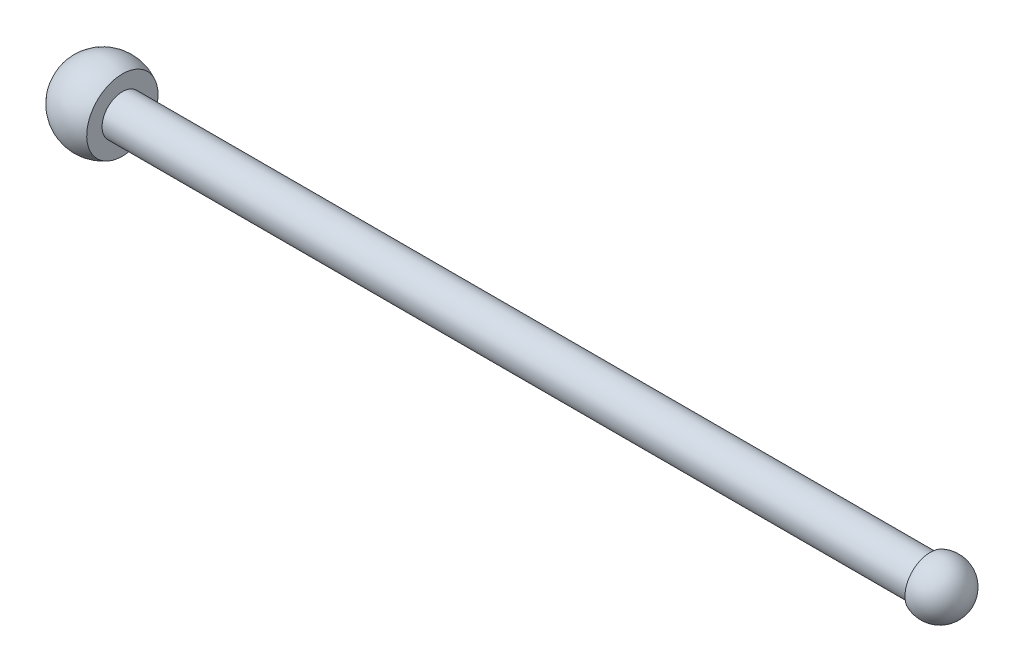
from build123d import *

# Parameters (mm, degrees)
SKETCH1_W = 393.192
SKETCH1_H = 9.525


with BuildPart() as part:
    # Sketch1 → Revolve1 (revolve)
    with BuildSketch(Plane.XY, mode=Mode.PRIVATE) as revolve1_sk:
        with Locations((0, 4.7625)):
            Rectangle(SKETCH1_W, SKETCH1_H)
    revolve(revolve1_sk.sketch.rotate(Axis((-211.592900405, 0, 0), (1, 0, 0)), 90), axis=Axis((-211.592900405, 0, 0), (1, 0, 0)))

    # Sketch2 → Revolve2 (revolve)
    with BuildSketch(Plane.XY, mode=Mode.PRIVATE) as revolve2_sk:
        with BuildLine():
            Line((192.069433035, 0), (209.296, 0))
            ThreePointArc((209.296, 0), (203.800255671, 10.458905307), (192.069433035, 11.865925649))
            Line((192.069433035, 11.865925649), (192.069433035, 0))
        make_face()
    revolve(revolve2_sk.sketch.rotate(Axis((0, 0, 0), (1, 0, 0)), 90), axis=Axis((0, 0, 0), (1, 0, 0)))

    # Sketch3 → Revolve3 (revolve)
    with BuildSketch(Plane.XY):
        with BuildLine():
            Line((-215.646, 0), (-187.532514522, 0))
            Line((-187.532514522, 0), (-187.532514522, 16.755767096))
            ThreePointArc((-187.532514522, 16.755767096), (-206.349027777, 16.364013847), (-215.646, 0))
        make_face()
    revolve(axis=Axis((-146.974679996, 0, 0), (-1, 0, 0)))


solid = part.part
